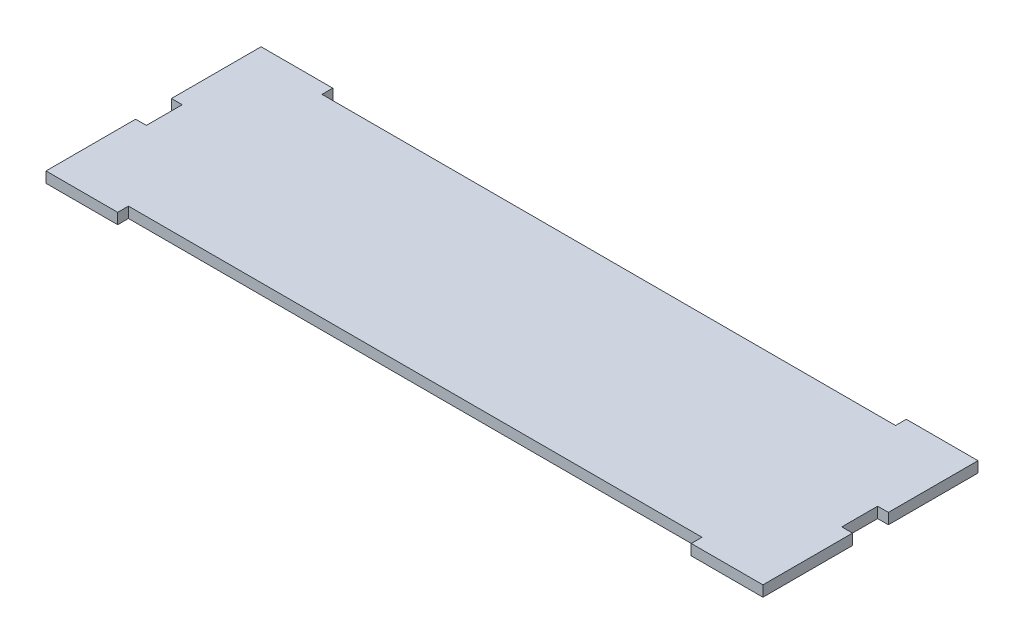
ISO-10303-21;
HEADER;
FILE_DESCRIPTION(('STEP AP214'),'2;1');
FILE_NAME('part.step','',(''),(''),'','','');
FILE_SCHEMA(('AUTOMOTIVE_DESIGN { 1 0 10303 214 1 1 1 1 }'));
ENDSEC;
DATA;
#1=APPLICATION_CONTEXT('core data for automotive mechanical design processes');
#2=APPLICATION_PROTOCOL_DEFINITION('international standard','automotive_design',2000,#1);
#3=PRODUCT_CONTEXT('',#1,'mechanical');
#4=PRODUCT('Part','Part','',(#3));
#5=PRODUCT_RELATED_PRODUCT_CATEGORY('part','',(#4));
#6=PRODUCT_DEFINITION_FORMATION('','',#4);
#7=PRODUCT_DEFINITION_CONTEXT('part definition',#1,'design');
#8=PRODUCT_DEFINITION('design','',#6,#7);
#9=PRODUCT_DEFINITION_SHAPE('','',#8);
#10=(LENGTH_UNIT() NAMED_UNIT(*) SI_UNIT(.MILLI.,.METRE.));
#11=(NAMED_UNIT(*) PLANE_ANGLE_UNIT() SI_UNIT($,.RADIAN.));
#12=(NAMED_UNIT(*) SI_UNIT($,.STERADIAN.) SOLID_ANGLE_UNIT());
#13=UNCERTAINTY_MEASURE_WITH_UNIT(LENGTH_MEASURE(1.E-05),#10,'distance_accuracy_value','');
#14=(GEOMETRIC_REPRESENTATION_CONTEXT(3) GLOBAL_UNCERTAINTY_ASSIGNED_CONTEXT((#13)) GLOBAL_UNIT_ASSIGNED_CONTEXT((#10,
#11,#12)) REPRESENTATION_CONTEXT('',''));
#15=CARTESIAN_POINT('',(0.,0.,0.));
#16=DIRECTION('',(0.,0.,1.));
#17=DIRECTION('',(1.,0.,0.));
#18=AXIS2_PLACEMENT_3D('',#15,#16,#17);
#19=CARTESIAN_POINT('',(-130.34412104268,3.,145.681167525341));
#20=DIRECTION('',(0.,0.,-1.));
#21=DIRECTION('',(-1.,0.,0.));
#22=AXIS2_PLACEMENT_3D('',#19,#20,#21);
#23=PLANE('',#22);
#24=DIRECTION('',(1.,0.,0.));
#25=VECTOR('',#24,1.);
#26=CARTESIAN_POINT('',(-130.34412104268,0.,145.681167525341));
#27=LINE('',#26,#25);
#28=CARTESIAN_POINT('',(-130.34412104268,0.,145.681167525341));
#29=VERTEX_POINT('',#28);
#30=CARTESIAN_POINT('',(29.65587895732,0.,145.681167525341));
#31=VERTEX_POINT('',#30);
#32=EDGE_CURVE('E201',#29,#31,#27,.T.);
#33=ORIENTED_EDGE('',*,*,#32,.T.);
#34=DIRECTION('',(0.,-1.,0.));
#35=VECTOR('',#34,1.);
#36=CARTESIAN_POINT('',(29.65587895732,3.,145.681167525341));
#37=LINE('',#36,#35);
#38=CARTESIAN_POINT('',(29.65587895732,3.,145.681167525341));
#39=VERTEX_POINT('',#38);
#40=EDGE_CURVE('E11',#39,#31,#37,.T.);
#41=ORIENTED_EDGE('',*,*,#40,.F.);
#42=DIRECTION('',(1.,0.,0.));
#43=VECTOR('',#42,1.);
#44=CARTESIAN_POINT('',(-130.34412104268,3.,145.681167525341));
#45=LINE('',#44,#43);
#46=CARTESIAN_POINT('',(-130.34412104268,3.,145.681167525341));
#47=VERTEX_POINT('',#46);
#48=EDGE_CURVE('E239',#47,#39,#45,.T.);
#49=ORIENTED_EDGE('',*,*,#48,.F.);
#50=DIRECTION('',(0.,-1.,0.));
#51=VECTOR('',#50,1.);
#52=CARTESIAN_POINT('',(-130.34412104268,3.,145.681167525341));
#53=LINE('',#52,#51);
#54=EDGE_CURVE('E197',#47,#29,#53,.T.);
#55=ORIENTED_EDGE('',*,*,#54,.T.);
#56=EDGE_LOOP('',(#33,#41,#49,#55));
#57=FACE_BOUND('',#56,.T.);
#58=ADVANCED_FACE('F33',(#57),#23,.F.);
#59=CARTESIAN_POINT('',(29.65587895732,3.,145.681167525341));
#60=DIRECTION('',(1.,0.,0.));
#61=DIRECTION('',(0.,0.,-1.));
#62=AXIS2_PLACEMENT_3D('',#59,#60,#61);
#63=PLANE('',#62);
#64=DIRECTION('',(0.,0.,1.));
#65=VECTOR('',#64,1.);
#66=CARTESIAN_POINT('',(29.65587895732,0.,145.681167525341));
#67=LINE('',#66,#65);
#68=CARTESIAN_POINT('',(29.65587895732,0.,148.681167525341));
#69=VERTEX_POINT('',#68);
#70=EDGE_CURVE('E204',#31,#69,#67,.T.);
#71=ORIENTED_EDGE('',*,*,#70,.T.);
#72=DIRECTION('',(0.,-1.,0.));
#73=VECTOR('',#72,1.);
#74=CARTESIAN_POINT('',(29.65587895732,3.,148.681167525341));
#75=LINE('',#74,#73);
#76=CARTESIAN_POINT('',(29.65587895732,3.,148.681167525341));
#77=VERTEX_POINT('',#76);
#78=EDGE_CURVE('E41',#77,#69,#75,.T.);
#79=ORIENTED_EDGE('',*,*,#78,.F.);
#80=DIRECTION('',(0.,0.,1.));
#81=VECTOR('',#80,1.);
#82=CARTESIAN_POINT('',(29.65587895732,3.,145.681167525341));
#83=LINE('',#82,#81);
#84=EDGE_CURVE('E128',#39,#77,#83,.T.);
#85=ORIENTED_EDGE('',*,*,#84,.F.);
#86=ORIENTED_EDGE('',*,*,#40,.T.);
#87=EDGE_LOOP('',(#71,#79,#85,#86));
#88=FACE_BOUND('',#87,.T.);
#89=ADVANCED_FACE('F357',(#88),#63,.F.);
#90=CARTESIAN_POINT('',(49.65587895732,3.,148.681167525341));
#91=DIRECTION('',(0.,0.,-1.));
#92=DIRECTION('',(-1.,0.,0.));
#93=AXIS2_PLACEMENT_3D('',#90,#91,#92);
#94=PLANE('',#93);
#95=DIRECTION('',(1.,0.,0.));
#96=VECTOR('',#95,1.);
#97=CARTESIAN_POINT('',(49.65587895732,0.,148.681167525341));
#98=LINE('',#97,#96);
#99=CARTESIAN_POINT('',(49.65587895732,0.,148.681167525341));
#100=VERTEX_POINT('',#99);
#101=EDGE_CURVE('E206',#69,#100,#98,.T.);
#102=ORIENTED_EDGE('',*,*,#101,.T.);
#103=DIRECTION('',(0.,-1.,0.));
#104=VECTOR('',#103,1.);
#105=CARTESIAN_POINT('',(49.65587895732,3.,148.681167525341));
#106=LINE('',#105,#104);
#107=CARTESIAN_POINT('',(49.65587895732,3.,148.681167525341));
#108=VERTEX_POINT('',#107);
#109=EDGE_CURVE('E282',#108,#100,#106,.T.);
#110=ORIENTED_EDGE('',*,*,#109,.F.);
#111=DIRECTION('',(1.,0.,0.));
#112=VECTOR('',#111,1.);
#113=CARTESIAN_POINT('',(49.65587895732,3.,148.681167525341));
#114=LINE('',#113,#112);
#115=EDGE_CURVE('E290',#77,#108,#114,.T.);
#116=ORIENTED_EDGE('',*,*,#115,.F.);
#117=ORIENTED_EDGE('',*,*,#78,.T.);
#118=EDGE_LOOP('',(#102,#110,#116,#117));
#119=FACE_BOUND('',#118,.T.);
#120=ADVANCED_FACE('F288',(#119),#94,.F.);
#121=CARTESIAN_POINT('',(49.65587895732,3.,123.681167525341));
#122=DIRECTION('',(-1.,0.,0.));
#123=DIRECTION('',(0.,0.,1.));
#124=AXIS2_PLACEMENT_3D('',#121,#122,#123);
#125=PLANE('',#124);
#126=DIRECTION('',(0.,0.,-1.));
#127=VECTOR('',#126,1.);
#128=CARTESIAN_POINT('',(49.65587895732,0.,123.681167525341));
#129=LINE('',#128,#127);
#130=CARTESIAN_POINT('',(49.65587895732,0.,123.681167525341));
#131=VERTEX_POINT('',#130);
#132=EDGE_CURVE('E208',#100,#131,#129,.T.);
#133=ORIENTED_EDGE('',*,*,#132,.T.);
#134=DIRECTION('',(0.,-1.,0.));
#135=VECTOR('',#134,1.);
#136=CARTESIAN_POINT('',(49.65587895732,3.,123.681167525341));
#137=LINE('',#136,#135);
#138=CARTESIAN_POINT('',(49.65587895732,3.,123.681167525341));
#139=VERTEX_POINT('',#138);
#140=EDGE_CURVE('E279',#139,#131,#137,.T.);
#141=ORIENTED_EDGE('',*,*,#140,.F.);
#142=DIRECTION('',(0.,0.,-1.));
#143=VECTOR('',#142,1.);
#144=CARTESIAN_POINT('',(49.65587895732,3.,123.681167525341));
#145=LINE('',#144,#143);
#146=EDGE_CURVE('E308',#108,#139,#145,.T.);
#147=ORIENTED_EDGE('',*,*,#146,.F.);
#148=ORIENTED_EDGE('',*,*,#109,.T.);
#149=EDGE_LOOP('',(#133,#141,#147,#148));
#150=FACE_BOUND('',#149,.T.);
#151=ADVANCED_FACE('F299',(#150),#125,.F.);
#152=CARTESIAN_POINT('',(46.65587895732,3.,123.681167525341));
#153=DIRECTION('',(0.,0.,1.));
#154=DIRECTION('',(1.,0.,0.));
#155=AXIS2_PLACEMENT_3D('',#152,#153,#154);
#156=PLANE('',#155);
#157=DIRECTION('',(-1.,0.,0.));
#158=VECTOR('',#157,1.);
#159=CARTESIAN_POINT('',(46.65587895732,0.,123.681167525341));
#160=LINE('',#159,#158);
#161=CARTESIAN_POINT('',(46.65587895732,0.,123.681167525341));
#162=VERTEX_POINT('',#161);
#163=EDGE_CURVE('E210',#131,#162,#160,.T.);
#164=ORIENTED_EDGE('',*,*,#163,.T.);
#165=DIRECTION('',(0.,-1.,0.));
#166=VECTOR('',#165,1.);
#167=CARTESIAN_POINT('',(46.65587895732,3.,123.681167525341));
#168=LINE('',#167,#166);
#169=CARTESIAN_POINT('',(46.65587895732,3.,123.681167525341));
#170=VERTEX_POINT('',#169);
#171=EDGE_CURVE('E276',#170,#162,#168,.T.);
#172=ORIENTED_EDGE('',*,*,#171,.F.);
#173=DIRECTION('',(-1.,0.,0.));
#174=VECTOR('',#173,1.);
#175=CARTESIAN_POINT('',(46.65587895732,3.,123.681167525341));
#176=LINE('',#175,#174);
#177=EDGE_CURVE('E305',#139,#170,#176,.T.);
#178=ORIENTED_EDGE('',*,*,#177,.F.);
#179=ORIENTED_EDGE('',*,*,#140,.T.);
#180=EDGE_LOOP('',(#164,#172,#178,#179));
#181=FACE_BOUND('',#180,.T.);
#182=ADVANCED_FACE('F303',(#181),#156,.F.);
#183=CARTESIAN_POINT('',(46.65587895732,3.,113.681167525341));
#184=DIRECTION('',(-1.,0.,0.));
#185=DIRECTION('',(0.,0.,1.));
#186=AXIS2_PLACEMENT_3D('',#183,#184,#185);
#187=PLANE('',#186);
#188=DIRECTION('',(0.,0.,-1.));
#189=VECTOR('',#188,1.);
#190=CARTESIAN_POINT('',(46.65587895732,0.,113.681167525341));
#191=LINE('',#190,#189);
#192=CARTESIAN_POINT('',(46.65587895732,0.,113.681167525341));
#193=VERTEX_POINT('',#192);
#194=EDGE_CURVE('E212',#162,#193,#191,.T.);
#195=ORIENTED_EDGE('',*,*,#194,.T.);
#196=DIRECTION('',(0.,-1.,0.));
#197=VECTOR('',#196,1.);
#198=CARTESIAN_POINT('',(46.65587895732,3.,113.681167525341));
#199=LINE('',#198,#197);
#200=CARTESIAN_POINT('',(46.65587895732,3.,113.681167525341));
#201=VERTEX_POINT('',#200);
#202=EDGE_CURVE('E273',#201,#193,#199,.T.);
#203=ORIENTED_EDGE('',*,*,#202,.F.);
#204=DIRECTION('',(0.,0.,-1.));
#205=VECTOR('',#204,1.);
#206=CARTESIAN_POINT('',(46.65587895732,3.,113.681167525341));
#207=LINE('',#206,#205);
#208=EDGE_CURVE('E307',#170,#201,#207,.T.);
#209=ORIENTED_EDGE('',*,*,#208,.F.);
#210=ORIENTED_EDGE('',*,*,#171,.T.);
#211=EDGE_LOOP('',(#195,#203,#209,#210));
#212=FACE_BOUND('',#211,.T.);
#213=ADVANCED_FACE('F370',(#212),#187,.F.);
#214=CARTESIAN_POINT('',(49.65587895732,3.,113.681167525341));
#215=DIRECTION('',(0.,0.,-1.));
#216=DIRECTION('',(-1.,0.,0.));
#217=AXIS2_PLACEMENT_3D('',#214,#215,#216);
#218=PLANE('',#217);
#219=DIRECTION('',(1.,0.,0.));
#220=VECTOR('',#219,1.);
#221=CARTESIAN_POINT('',(49.65587895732,0.,113.681167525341));
#222=LINE('',#221,#220);
#223=CARTESIAN_POINT('',(49.65587895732,0.,113.681167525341));
#224=VERTEX_POINT('',#223);
#225=EDGE_CURVE('E214',#193,#224,#222,.T.);
#226=ORIENTED_EDGE('',*,*,#225,.T.);
#227=DIRECTION('',(0.,-1.,0.));
#228=VECTOR('',#227,1.);
#229=CARTESIAN_POINT('',(49.65587895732,3.,113.681167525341));
#230=LINE('',#229,#228);
#231=CARTESIAN_POINT('',(49.65587895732,3.,113.681167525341));
#232=VERTEX_POINT('',#231);
#233=EDGE_CURVE('E270',#232,#224,#230,.T.);
#234=ORIENTED_EDGE('',*,*,#233,.F.);
#235=DIRECTION('',(1.,0.,0.));
#236=VECTOR('',#235,1.);
#237=CARTESIAN_POINT('',(49.65587895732,3.,113.681167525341));
#238=LINE('',#237,#236);
#239=EDGE_CURVE('E310',#201,#232,#238,.T.);
#240=ORIENTED_EDGE('',*,*,#239,.F.);
#241=ORIENTED_EDGE('',*,*,#202,.T.);
#242=EDGE_LOOP('',(#226,#234,#240,#241));
#243=FACE_BOUND('',#242,.T.);
#244=ADVANCED_FACE('F373',(#243),#218,.F.);
#245=CARTESIAN_POINT('',(49.65587895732,3.,88.6811675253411));
#246=DIRECTION('',(-1.,0.,0.));
#247=DIRECTION('',(0.,0.,1.));
#248=AXIS2_PLACEMENT_3D('',#245,#246,#247);
#249=PLANE('',#248);
#250=DIRECTION('',(0.,0.,-1.));
#251=VECTOR('',#250,1.);
#252=CARTESIAN_POINT('',(49.65587895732,0.,88.6811675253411));
#253=LINE('',#252,#251);
#254=CARTESIAN_POINT('',(49.65587895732,0.,88.6811675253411));
#255=VERTEX_POINT('',#254);
#256=EDGE_CURVE('E216',#224,#255,#253,.T.);
#257=ORIENTED_EDGE('',*,*,#256,.T.);
#258=DIRECTION('',(0.,-1.,0.));
#259=VECTOR('',#258,1.);
#260=CARTESIAN_POINT('',(49.65587895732,3.,88.6811675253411));
#261=LINE('',#260,#259);
#262=CARTESIAN_POINT('',(49.65587895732,3.,88.6811675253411));
#263=VERTEX_POINT('',#262);
#264=EDGE_CURVE('E267',#263,#255,#261,.T.);
#265=ORIENTED_EDGE('',*,*,#264,.F.);
#266=DIRECTION('',(0.,0.,-1.));
#267=VECTOR('',#266,1.);
#268=CARTESIAN_POINT('',(49.65587895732,3.,88.6811675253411));
#269=LINE('',#268,#267);
#270=EDGE_CURVE('E316',#232,#263,#269,.T.);
#271=ORIENTED_EDGE('',*,*,#270,.F.);
#272=ORIENTED_EDGE('',*,*,#233,.T.);
#273=EDGE_LOOP('',(#257,#265,#271,#272));
#274=FACE_BOUND('',#273,.T.);
#275=ADVANCED_FACE('F377',(#274),#249,.F.);
#276=CARTESIAN_POINT('',(29.65587895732,3.,88.6811675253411));
#277=DIRECTION('',(0.,0.,1.));
#278=DIRECTION('',(1.,0.,0.));
#279=AXIS2_PLACEMENT_3D('',#276,#277,#278);
#280=PLANE('',#279);
#281=DIRECTION('',(-1.,0.,0.));
#282=VECTOR('',#281,1.);
#283=CARTESIAN_POINT('',(29.65587895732,0.,88.6811675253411));
#284=LINE('',#283,#282);
#285=CARTESIAN_POINT('',(29.65587895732,0.,88.6811675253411));
#286=VERTEX_POINT('',#285);
#287=EDGE_CURVE('E218',#255,#286,#284,.T.);
#288=ORIENTED_EDGE('',*,*,#287,.T.);
#289=DIRECTION('',(0.,-1.,0.));
#290=VECTOR('',#289,1.);
#291=CARTESIAN_POINT('',(29.65587895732,3.,88.6811675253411));
#292=LINE('',#291,#290);
#293=CARTESIAN_POINT('',(29.65587895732,3.,88.6811675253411));
#294=VERTEX_POINT('',#293);
#295=EDGE_CURVE('E264',#294,#286,#292,.T.);
#296=ORIENTED_EDGE('',*,*,#295,.F.);
#297=DIRECTION('',(-1.,0.,0.));
#298=VECTOR('',#297,1.);
#299=CARTESIAN_POINT('',(29.65587895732,3.,88.6811675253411));
#300=LINE('',#299,#298);
#301=EDGE_CURVE('E318',#263,#294,#300,.T.);
#302=ORIENTED_EDGE('',*,*,#301,.F.);
#303=ORIENTED_EDGE('',*,*,#264,.T.);
#304=EDGE_LOOP('',(#288,#296,#302,#303));
#305=FACE_BOUND('',#304,.T.);
#306=ADVANCED_FACE('F381',(#305),#280,.F.);
#307=CARTESIAN_POINT('',(29.65587895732,3.,91.6811675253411));
#308=DIRECTION('',(1.,0.,0.));
#309=DIRECTION('',(0.,0.,-1.));
#310=AXIS2_PLACEMENT_3D('',#307,#308,#309);
#311=PLANE('',#310);
#312=DIRECTION('',(0.,0.,1.));
#313=VECTOR('',#312,1.);
#314=CARTESIAN_POINT('',(29.65587895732,0.,91.6811675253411));
#315=LINE('',#314,#313);
#316=CARTESIAN_POINT('',(29.65587895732,0.,91.6811675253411));
#317=VERTEX_POINT('',#316);
#318=EDGE_CURVE('E220',#286,#317,#315,.T.);
#319=ORIENTED_EDGE('',*,*,#318,.T.);
#320=DIRECTION('',(0.,-1.,0.));
#321=VECTOR('',#320,1.);
#322=CARTESIAN_POINT('',(29.65587895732,3.,91.6811675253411));
#323=LINE('',#322,#321);
#324=CARTESIAN_POINT('',(29.65587895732,3.,91.6811675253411));
#325=VERTEX_POINT('',#324);
#326=EDGE_CURVE('E261',#325,#317,#323,.T.);
#327=ORIENTED_EDGE('',*,*,#326,.F.);
#328=DIRECTION('',(0.,0.,1.));
#329=VECTOR('',#328,1.);
#330=CARTESIAN_POINT('',(29.65587895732,3.,91.6811675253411));
#331=LINE('',#330,#329);
#332=EDGE_CURVE('E320',#294,#325,#331,.T.);
#333=ORIENTED_EDGE('',*,*,#332,.F.);
#334=ORIENTED_EDGE('',*,*,#295,.T.);
#335=EDGE_LOOP('',(#319,#327,#333,#334));
#336=FACE_BOUND('',#335,.T.);
#337=ADVANCED_FACE('F385',(#336),#311,.F.);
#338=CARTESIAN_POINT('',(29.65587895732,3.,91.6811675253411));
#339=DIRECTION('',(0.,0.,1.));
#340=DIRECTION('',(1.,0.,0.));
#341=AXIS2_PLACEMENT_3D('',#338,#339,#340);
#342=PLANE('',#341);
#343=DIRECTION('',(-1.,0.,0.));
#344=VECTOR('',#343,1.);
#345=CARTESIAN_POINT('',(29.65587895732,0.,91.6811675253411));
#346=LINE('',#345,#344);
#347=CARTESIAN_POINT('',(-130.34412104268,0.,91.6811675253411));
#348=VERTEX_POINT('',#347);
#349=EDGE_CURVE('E222',#317,#348,#346,.T.);
#350=ORIENTED_EDGE('',*,*,#349,.T.);
#351=DIRECTION('',(0.,-1.,0.));
#352=VECTOR('',#351,1.);
#353=CARTESIAN_POINT('',(-130.34412104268,3.,91.6811675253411));
#354=LINE('',#353,#352);
#355=CARTESIAN_POINT('',(-130.34412104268,3.,91.6811675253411));
#356=VERTEX_POINT('',#355);
#357=EDGE_CURVE('E258',#356,#348,#354,.T.);
#358=ORIENTED_EDGE('',*,*,#357,.F.);
#359=DIRECTION('',(-1.,0.,0.));
#360=VECTOR('',#359,1.);
#361=CARTESIAN_POINT('',(29.65587895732,3.,91.6811675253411));
#362=LINE('',#361,#360);
#363=EDGE_CURVE('E322',#325,#356,#362,.T.);
#364=ORIENTED_EDGE('',*,*,#363,.F.);
#365=ORIENTED_EDGE('',*,*,#326,.T.);
#366=EDGE_LOOP('',(#350,#358,#364,#365));
#367=FACE_BOUND('',#366,.T.);
#368=ADVANCED_FACE('F389',(#367),#342,.F.);
#369=CARTESIAN_POINT('',(-130.34412104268,3.,91.6811675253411));
#370=DIRECTION('',(-1.,0.,0.));
#371=DIRECTION('',(0.,0.,1.));
#372=AXIS2_PLACEMENT_3D('',#369,#370,#371);
#373=PLANE('',#372);
#374=DIRECTION('',(0.,0.,-1.));
#375=VECTOR('',#374,1.);
#376=CARTESIAN_POINT('',(-130.34412104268,0.,91.6811675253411));
#377=LINE('',#376,#375);
#378=CARTESIAN_POINT('',(-130.34412104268,0.,88.6811675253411));
#379=VERTEX_POINT('',#378);
#380=EDGE_CURVE('E224',#348,#379,#377,.T.);
#381=ORIENTED_EDGE('',*,*,#380,.T.);
#382=DIRECTION('',(0.,-1.,0.));
#383=VECTOR('',#382,1.);
#384=CARTESIAN_POINT('',(-130.34412104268,3.,88.6811675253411));
#385=LINE('',#384,#383);
#386=CARTESIAN_POINT('',(-130.34412104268,3.,88.6811675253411));
#387=VERTEX_POINT('',#386);
#388=EDGE_CURVE('E255',#387,#379,#385,.T.);
#389=ORIENTED_EDGE('',*,*,#388,.F.);
#390=DIRECTION('',(0.,0.,-1.));
#391=VECTOR('',#390,1.);
#392=CARTESIAN_POINT('',(-130.34412104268,3.,91.6811675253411));
#393=LINE('',#392,#391);
#394=EDGE_CURVE('E324',#356,#387,#393,.T.);
#395=ORIENTED_EDGE('',*,*,#394,.F.);
#396=ORIENTED_EDGE('',*,*,#357,.T.);
#397=EDGE_LOOP('',(#381,#389,#395,#396));
#398=FACE_BOUND('',#397,.T.);
#399=ADVANCED_FACE('F393',(#398),#373,.F.);
#400=CARTESIAN_POINT('',(-150.34412104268,3.,88.6811675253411));
#401=DIRECTION('',(0.,0.,1.));
#402=DIRECTION('',(1.,0.,0.));
#403=AXIS2_PLACEMENT_3D('',#400,#401,#402);
#404=PLANE('',#403);
#405=DIRECTION('',(-1.,0.,0.));
#406=VECTOR('',#405,1.);
#407=CARTESIAN_POINT('',(-150.34412104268,0.,88.6811675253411));
#408=LINE('',#407,#406);
#409=CARTESIAN_POINT('',(-150.34412104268,0.,88.6811675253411));
#410=VERTEX_POINT('',#409);
#411=EDGE_CURVE('E226',#379,#410,#408,.T.);
#412=ORIENTED_EDGE('',*,*,#411,.T.);
#413=DIRECTION('',(0.,-1.,0.));
#414=VECTOR('',#413,1.);
#415=CARTESIAN_POINT('',(-150.34412104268,3.,88.6811675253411));
#416=LINE('',#415,#414);
#417=CARTESIAN_POINT('',(-150.34412104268,3.,88.6811675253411));
#418=VERTEX_POINT('',#417);
#419=EDGE_CURVE('E252',#418,#410,#416,.T.);
#420=ORIENTED_EDGE('',*,*,#419,.F.);
#421=DIRECTION('',(-1.,0.,0.));
#422=VECTOR('',#421,1.);
#423=CARTESIAN_POINT('',(-150.34412104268,3.,88.6811675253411));
#424=LINE('',#423,#422);
#425=EDGE_CURVE('E326',#387,#418,#424,.T.);
#426=ORIENTED_EDGE('',*,*,#425,.F.);
#427=ORIENTED_EDGE('',*,*,#388,.T.);
#428=EDGE_LOOP('',(#412,#420,#426,#427));
#429=FACE_BOUND('',#428,.T.);
#430=ADVANCED_FACE('F397',(#429),#404,.F.);
#431=CARTESIAN_POINT('',(-150.34412104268,3.,88.6811675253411));
#432=DIRECTION('',(1.,0.,0.));
#433=DIRECTION('',(0.,0.,-1.));
#434=AXIS2_PLACEMENT_3D('',#431,#432,#433);
#435=PLANE('',#434);
#436=DIRECTION('',(0.,0.,1.));
#437=VECTOR('',#436,1.);
#438=CARTESIAN_POINT('',(-150.34412104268,0.,88.6811675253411));
#439=LINE('',#438,#437);
#440=CARTESIAN_POINT('',(-150.34412104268,0.,113.681167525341));
#441=VERTEX_POINT('',#440);
#442=EDGE_CURVE('E228',#410,#441,#439,.T.);
#443=ORIENTED_EDGE('',*,*,#442,.T.);
#444=DIRECTION('',(0.,-1.,0.));
#445=VECTOR('',#444,1.);
#446=CARTESIAN_POINT('',(-150.34412104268,3.,113.681167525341));
#447=LINE('',#446,#445);
#448=CARTESIAN_POINT('',(-150.34412104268,3.,113.681167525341));
#449=VERTEX_POINT('',#448);
#450=EDGE_CURVE('E249',#449,#441,#447,.T.);
#451=ORIENTED_EDGE('',*,*,#450,.F.);
#452=DIRECTION('',(0.,0.,1.));
#453=VECTOR('',#452,1.);
#454=CARTESIAN_POINT('',(-150.34412104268,3.,88.6811675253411));
#455=LINE('',#454,#453);
#456=EDGE_CURVE('E328',#418,#449,#455,.T.);
#457=ORIENTED_EDGE('',*,*,#456,.F.);
#458=ORIENTED_EDGE('',*,*,#419,.T.);
#459=EDGE_LOOP('',(#443,#451,#457,#458));
#460=FACE_BOUND('',#459,.T.);
#461=ADVANCED_FACE('F401',(#460),#435,.F.);
#462=CARTESIAN_POINT('',(-147.34412104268,3.,113.681167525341));
#463=DIRECTION('',(0.,0.,-1.));
#464=DIRECTION('',(-1.,0.,0.));
#465=AXIS2_PLACEMENT_3D('',#462,#463,#464);
#466=PLANE('',#465);
#467=DIRECTION('',(1.,0.,0.));
#468=VECTOR('',#467,1.);
#469=CARTESIAN_POINT('',(-147.34412104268,0.,113.681167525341));
#470=LINE('',#469,#468);
#471=CARTESIAN_POINT('',(-147.34412104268,0.,113.681167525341));
#472=VERTEX_POINT('',#471);
#473=EDGE_CURVE('E230',#441,#472,#470,.T.);
#474=ORIENTED_EDGE('',*,*,#473,.T.);
#475=DIRECTION('',(0.,-1.,0.));
#476=VECTOR('',#475,1.);
#477=CARTESIAN_POINT('',(-147.34412104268,3.,113.681167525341));
#478=LINE('',#477,#476);
#479=CARTESIAN_POINT('',(-147.34412104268,3.,113.681167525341));
#480=VERTEX_POINT('',#479);
#481=EDGE_CURVE('E246',#480,#472,#478,.T.);
#482=ORIENTED_EDGE('',*,*,#481,.F.);
#483=DIRECTION('',(1.,0.,0.));
#484=VECTOR('',#483,1.);
#485=CARTESIAN_POINT('',(-147.34412104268,3.,113.681167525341));
#486=LINE('',#485,#484);
#487=EDGE_CURVE('E330',#449,#480,#486,.T.);
#488=ORIENTED_EDGE('',*,*,#487,.F.);
#489=ORIENTED_EDGE('',*,*,#450,.T.);
#490=EDGE_LOOP('',(#474,#482,#488,#489));
#491=FACE_BOUND('',#490,.T.);
#492=ADVANCED_FACE('F405',(#491),#466,.F.);
#493=CARTESIAN_POINT('',(-147.34412104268,3.,113.681167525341));
#494=DIRECTION('',(1.,0.,0.));
#495=DIRECTION('',(0.,0.,-1.));
#496=AXIS2_PLACEMENT_3D('',#493,#494,#495);
#497=PLANE('',#496);
#498=DIRECTION('',(0.,0.,1.));
#499=VECTOR('',#498,1.);
#500=CARTESIAN_POINT('',(-147.34412104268,0.,113.681167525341));
#501=LINE('',#500,#499);
#502=CARTESIAN_POINT('',(-147.34412104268,0.,123.681167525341));
#503=VERTEX_POINT('',#502);
#504=EDGE_CURVE('E232',#472,#503,#501,.T.);
#505=ORIENTED_EDGE('',*,*,#504,.T.);
#506=DIRECTION('',(0.,-1.,0.));
#507=VECTOR('',#506,1.);
#508=CARTESIAN_POINT('',(-147.34412104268,3.,123.681167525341));
#509=LINE('',#508,#507);
#510=CARTESIAN_POINT('',(-147.34412104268,3.,123.681167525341));
#511=VERTEX_POINT('',#510);
#512=EDGE_CURVE('E243',#511,#503,#509,.T.);
#513=ORIENTED_EDGE('',*,*,#512,.F.);
#514=DIRECTION('',(0.,0.,1.));
#515=VECTOR('',#514,1.);
#516=CARTESIAN_POINT('',(-147.34412104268,3.,113.681167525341));
#517=LINE('',#516,#515);
#518=EDGE_CURVE('E332',#480,#511,#517,.T.);
#519=ORIENTED_EDGE('',*,*,#518,.F.);
#520=ORIENTED_EDGE('',*,*,#481,.T.);
#521=EDGE_LOOP('',(#505,#513,#519,#520));
#522=FACE_BOUND('',#521,.T.);
#523=ADVANCED_FACE('F338',(#522),#497,.F.);
#524=CARTESIAN_POINT('',(-150.34412104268,3.,123.681167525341));
#525=DIRECTION('',(0.,0.,1.));
#526=DIRECTION('',(1.,0.,0.));
#527=AXIS2_PLACEMENT_3D('',#524,#525,#526);
#528=PLANE('',#527);
#529=DIRECTION('',(-1.,0.,0.));
#530=VECTOR('',#529,1.);
#531=CARTESIAN_POINT('',(-150.34412104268,0.,123.681167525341));
#532=LINE('',#531,#530);
#533=CARTESIAN_POINT('',(-150.34412104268,0.,123.681167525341));
#534=VERTEX_POINT('',#533);
#535=EDGE_CURVE('E234',#503,#534,#532,.T.);
#536=ORIENTED_EDGE('',*,*,#535,.T.);
#537=DIRECTION('',(0.,-1.,0.));
#538=VECTOR('',#537,1.);
#539=CARTESIAN_POINT('',(-150.34412104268,3.,123.681167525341));
#540=LINE('',#539,#538);
#541=CARTESIAN_POINT('',(-150.34412104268,3.,123.681167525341));
#542=VERTEX_POINT('',#541);
#543=EDGE_CURVE('E192',#542,#534,#540,.T.);
#544=ORIENTED_EDGE('',*,*,#543,.F.);
#545=DIRECTION('',(-1.,0.,0.));
#546=VECTOR('',#545,1.);
#547=CARTESIAN_POINT('',(-150.34412104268,3.,123.681167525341));
#548=LINE('',#547,#546);
#549=EDGE_CURVE('E183',#511,#542,#548,.T.);
#550=ORIENTED_EDGE('',*,*,#549,.F.);
#551=ORIENTED_EDGE('',*,*,#512,.T.);
#552=EDGE_LOOP('',(#536,#544,#550,#551));
#553=FACE_BOUND('',#552,.T.);
#554=ADVANCED_FACE('F342',(#553),#528,.F.);
#555=CARTESIAN_POINT('',(-150.34412104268,3.,123.681167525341));
#556=DIRECTION('',(1.,0.,0.));
#557=DIRECTION('',(0.,0.,-1.));
#558=AXIS2_PLACEMENT_3D('',#555,#556,#557);
#559=PLANE('',#558);
#560=DIRECTION('',(0.,0.,1.));
#561=VECTOR('',#560,1.);
#562=CARTESIAN_POINT('',(-150.34412104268,0.,123.681167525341));
#563=LINE('',#562,#561);
#564=CARTESIAN_POINT('',(-150.34412104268,0.,148.681167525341));
#565=VERTEX_POINT('',#564);
#566=EDGE_CURVE('E191',#534,#565,#563,.T.);
#567=ORIENTED_EDGE('',*,*,#566,.T.);
#568=DIRECTION('',(0.,-1.,0.));
#569=VECTOR('',#568,1.);
#570=CARTESIAN_POINT('',(-150.34412104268,3.,148.681167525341));
#571=LINE('',#570,#569);
#572=CARTESIAN_POINT('',(-150.34412104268,3.,148.681167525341));
#573=VERTEX_POINT('',#572);
#574=EDGE_CURVE('E188',#573,#565,#571,.T.);
#575=ORIENTED_EDGE('',*,*,#574,.F.);
#576=DIRECTION('',(0.,0.,1.));
#577=VECTOR('',#576,1.);
#578=CARTESIAN_POINT('',(-150.34412104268,3.,123.681167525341));
#579=LINE('',#578,#577);
#580=EDGE_CURVE('E177',#542,#573,#579,.T.);
#581=ORIENTED_EDGE('',*,*,#580,.F.);
#582=ORIENTED_EDGE('',*,*,#543,.T.);
#583=EDGE_LOOP('',(#567,#575,#581,#582));
#584=FACE_BOUND('',#583,.T.);
#585=ADVANCED_FACE('F189',(#584),#559,.F.);
#586=CARTESIAN_POINT('',(-130.34412104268,3.,148.681167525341));
#587=DIRECTION('',(0.,0.,-1.));
#588=DIRECTION('',(-1.,0.,0.));
#589=AXIS2_PLACEMENT_3D('',#586,#587,#588);
#590=PLANE('',#589);
#591=DIRECTION('',(1.,0.,0.));
#592=VECTOR('',#591,1.);
#593=CARTESIAN_POINT('',(-130.34412104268,0.,148.681167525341));
#594=LINE('',#593,#592);
#595=CARTESIAN_POINT('',(-130.34412104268,0.,148.681167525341));
#596=VERTEX_POINT('',#595);
#597=EDGE_CURVE('E114',#565,#596,#594,.T.);
#598=ORIENTED_EDGE('',*,*,#597,.T.);
#599=DIRECTION('',(0.,-1.,0.));
#600=VECTOR('',#599,1.);
#601=CARTESIAN_POINT('',(-130.34412104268,3.,148.681167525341));
#602=LINE('',#601,#600);
#603=CARTESIAN_POINT('',(-130.34412104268,3.,148.681167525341));
#604=VERTEX_POINT('',#603);
#605=EDGE_CURVE('E193',#604,#596,#602,.T.);
#606=ORIENTED_EDGE('',*,*,#605,.F.);
#607=DIRECTION('',(1.,0.,0.));
#608=VECTOR('',#607,1.);
#609=CARTESIAN_POINT('',(-130.34412104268,3.,148.681167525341));
#610=LINE('',#609,#608);
#611=EDGE_CURVE('E181',#573,#604,#610,.T.);
#612=ORIENTED_EDGE('',*,*,#611,.F.);
#613=ORIENTED_EDGE('',*,*,#574,.T.);
#614=EDGE_LOOP('',(#598,#606,#612,#613));
#615=FACE_BOUND('',#614,.T.);
#616=ADVANCED_FACE('F195',(#615),#590,.F.);
#617=CARTESIAN_POINT('',(-130.34412104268,3.,148.681167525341));
#618=DIRECTION('',(-1.,0.,0.));
#619=DIRECTION('',(0.,0.,1.));
#620=AXIS2_PLACEMENT_3D('',#617,#618,#619);
#621=PLANE('',#620);
#622=DIRECTION('',(0.,0.,-1.));
#623=VECTOR('',#622,1.);
#624=CARTESIAN_POINT('',(-130.34412104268,0.,148.681167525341));
#625=LINE('',#624,#623);
#626=EDGE_CURVE('E120',#596,#29,#625,.T.);
#627=ORIENTED_EDGE('',*,*,#626,.T.);
#628=ORIENTED_EDGE('',*,*,#54,.F.);
#629=DIRECTION('',(0.,0.,-1.));
#630=VECTOR('',#629,1.);
#631=CARTESIAN_POINT('',(-130.34412104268,3.,148.681167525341));
#632=LINE('',#631,#630);
#633=EDGE_CURVE('E49',#604,#47,#632,.T.);
#634=ORIENTED_EDGE('',*,*,#633,.F.);
#635=ORIENTED_EDGE('',*,*,#605,.T.);
#636=EDGE_LOOP('',(#627,#628,#634,#635));
#637=FACE_BOUND('',#636,.T.);
#638=ADVANCED_FACE('F346',(#637),#621,.F.);
#639=CARTESIAN_POINT('',(29.65587895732,3.,145.681167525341));
#640=DIRECTION('',(0.,-1.,0.));
#641=DIRECTION('',(0.,0.,-1.));
#642=AXIS2_PLACEMENT_3D('',#639,#640,#641);
#643=PLANE('',#642);
#644=ORIENTED_EDGE('',*,*,#48,.T.);
#645=ORIENTED_EDGE('',*,*,#84,.T.);
#646=ORIENTED_EDGE('',*,*,#115,.T.);
#647=ORIENTED_EDGE('',*,*,#146,.T.);
#648=ORIENTED_EDGE('',*,*,#177,.T.);
#649=ORIENTED_EDGE('',*,*,#208,.T.);
#650=ORIENTED_EDGE('',*,*,#239,.T.);
#651=ORIENTED_EDGE('',*,*,#270,.T.);
#652=ORIENTED_EDGE('',*,*,#301,.T.);
#653=ORIENTED_EDGE('',*,*,#332,.T.);
#654=ORIENTED_EDGE('',*,*,#363,.T.);
#655=ORIENTED_EDGE('',*,*,#394,.T.);
#656=ORIENTED_EDGE('',*,*,#425,.T.);
#657=ORIENTED_EDGE('',*,*,#456,.T.);
#658=ORIENTED_EDGE('',*,*,#487,.T.);
#659=ORIENTED_EDGE('',*,*,#518,.T.);
#660=ORIENTED_EDGE('',*,*,#549,.T.);
#661=ORIENTED_EDGE('',*,*,#580,.T.);
#662=ORIENTED_EDGE('',*,*,#611,.T.);
#663=ORIENTED_EDGE('',*,*,#633,.T.);
#664=EDGE_LOOP('',(#644,#645,#646,#647,#648,#649,#650,#651,#652,#653,#654,#655,#656,#657,#658,
#659,#660,#661,#662,#663));
#665=FACE_BOUND('',#664,.T.);
#666=ADVANCED_FACE('F179',(#665),#643,.F.);
#667=CARTESIAN_POINT('',(29.65587895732,0.,145.681167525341));
#668=DIRECTION('',(0.,-1.,0.));
#669=DIRECTION('',(0.,0.,-1.));
#670=AXIS2_PLACEMENT_3D('',#667,#668,#669);
#671=PLANE('',#670);
#672=ORIENTED_EDGE('',*,*,#32,.F.);
#673=ORIENTED_EDGE('',*,*,#626,.F.);
#674=ORIENTED_EDGE('',*,*,#597,.F.);
#675=ORIENTED_EDGE('',*,*,#566,.F.);
#676=ORIENTED_EDGE('',*,*,#535,.F.);
#677=ORIENTED_EDGE('',*,*,#504,.F.);
#678=ORIENTED_EDGE('',*,*,#473,.F.);
#679=ORIENTED_EDGE('',*,*,#442,.F.);
#680=ORIENTED_EDGE('',*,*,#411,.F.);
#681=ORIENTED_EDGE('',*,*,#380,.F.);
#682=ORIENTED_EDGE('',*,*,#349,.F.);
#683=ORIENTED_EDGE('',*,*,#318,.F.);
#684=ORIENTED_EDGE('',*,*,#287,.F.);
#685=ORIENTED_EDGE('',*,*,#256,.F.);
#686=ORIENTED_EDGE('',*,*,#225,.F.);
#687=ORIENTED_EDGE('',*,*,#194,.F.);
#688=ORIENTED_EDGE('',*,*,#163,.F.);
#689=ORIENTED_EDGE('',*,*,#132,.F.);
#690=ORIENTED_EDGE('',*,*,#101,.F.);
#691=ORIENTED_EDGE('',*,*,#70,.F.);
#692=EDGE_LOOP('',(#672,#673,#674,#675,#676,#677,#678,#679,#680,#681,#682,#683,#684,#685,#686,
#687,#688,#689,#690,#691));
#693=FACE_BOUND('',#692,.T.);
#694=ADVANCED_FACE('F294',(#693),#671,.T.);
#695=CLOSED_SHELL('',(#58,#89,#120,#151,#182,#213,#244,#275,#306,#337,#368,#399,#430,#461,#492,
#523,#554,#585,#616,#638,#666,#694));
#696=MANIFOLD_SOLID_BREP('B2',#695);
#697=ADVANCED_BREP_SHAPE_REPRESENTATION('',(#18,#696),#14);
#698=SHAPE_DEFINITION_REPRESENTATION(#9,#697);
ENDSEC;
END-ISO-10303-21;
